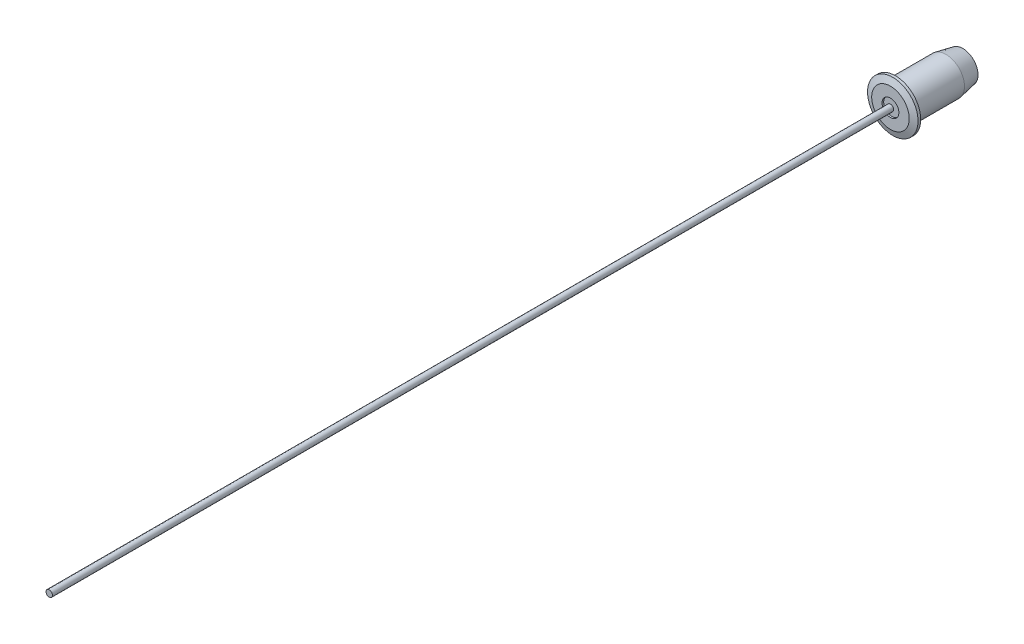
from build123d import *

# Parameters (mm, degrees)
SKETCH1_R           = 7.5
BOSS_EXTRUDE1_DEPTH = 1.5
CHAMFER2_SIZE       = 0.7
CHAMFER2_SIZE2      = 1.923234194
SKETCH2_R           = 5.5
BOSS_EXTRUDE2_DEPTH = 20
CHAMFER3_SIZE       = 5
CHAMFER3_SIZE2      = 0.971901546
SKETCH3_R           = 2.5
CUT_EXTRUDE1_DEPTH  = 0.5
SKETCH5_R           = 0.954691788
BOSS_EXTRUDE4_DEPTH = 250


with BuildPart() as part:
    # Sketch1 → Boss-Extrude1 (new body)
    with BuildSketch(Plane.XY):
        Circle(SKETCH1_R)
    extrude(amount=BOSS_EXTRUDE1_DEPTH)

    # Chamfer2
    chamfer2_edges = [part.edges().sort_by_distance(p)[0] for p in [
        (-7.5, 0, 1.5),
    ]]
    chamfer2_side = [part.faces().sort_by_distance(p)[0] for p in [
        (-7.5, 0, 0.75),
    ]]
    chamfer(chamfer2_edges, length=CHAMFER2_SIZE, length2=CHAMFER2_SIZE2, reference=chamfer2_side[0])

    # Sketch2 → Boss-Extrude2 (add)
    with BuildSketch(Plane(origin=(0, 0, 0), x_dir=(-1, 0, 0), z_dir=(0, 0, -1))):
        with Locations(Location((0, 0, 0), (0, 0, 180))):
            Circle(SKETCH2_R)
    extrude(amount=BOSS_EXTRUDE2_DEPTH)

    # Chamfer3
    chamfer3_edges = [part.edges().sort_by_distance(p)[0] for p in [
        (-5.5, 0, -20),
    ]]
    chamfer3_side = [part.faces().sort_by_distance(p)[0] for p in [
        (-5.5, 0, -10),
    ]]
    chamfer(chamfer3_edges, length=CHAMFER3_SIZE, length2=CHAMFER3_SIZE2, reference=chamfer3_side[0])

    # Sketch3 → Cut-Extrude1 (cut)
    with BuildSketch(Plane.XY.offset(1.5)):
        Circle(SKETCH3_R)
    extrude(amount=-CUT_EXTRUDE1_DEPTH, mode=Mode.SUBTRACT)


with BuildPart() as body_2:
    # Sketch5 → Boss-Extrude4 (new body)
    with BuildSketch(Plane.XY.offset(1.5)):
        Circle(SKETCH5_R)
    extrude(amount=BOSS_EXTRUDE4_DEPTH)


solid = Compound([part.part, body_2.part])
